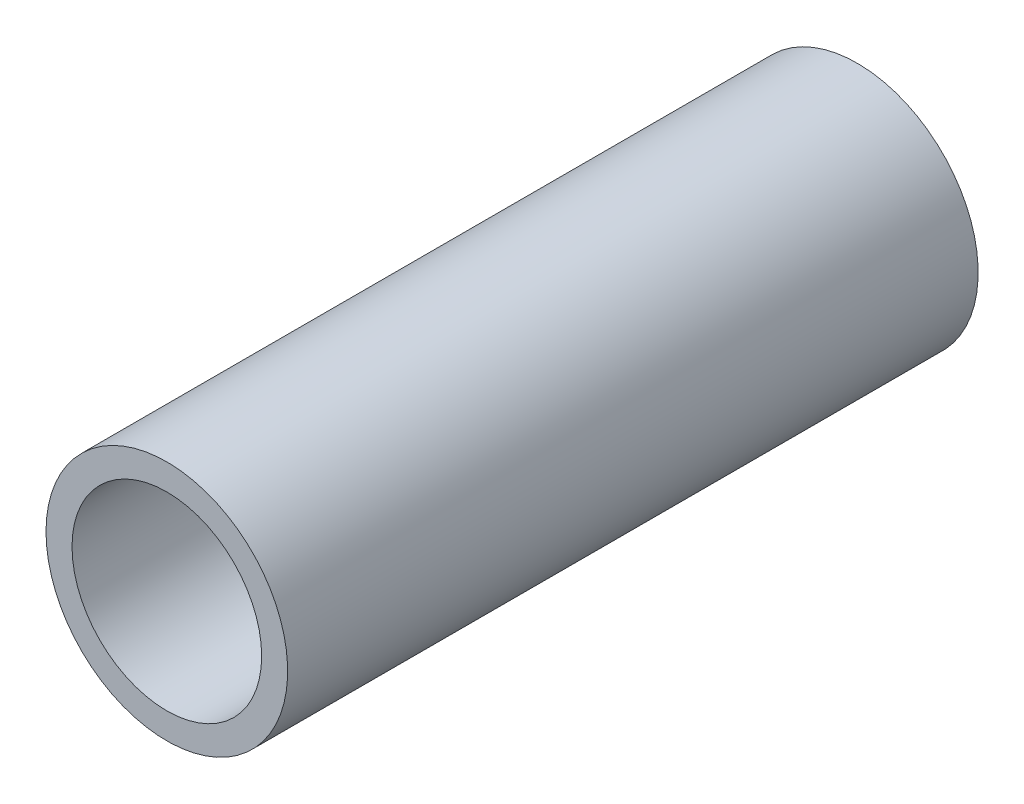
ISO-10303-21;
HEADER;
FILE_DESCRIPTION(('STEP AP214'),'2;1');
FILE_NAME('part.step','',(''),(''),'','','');
FILE_SCHEMA(('AUTOMOTIVE_DESIGN { 1 0 10303 214 1 1 1 1 }'));
ENDSEC;
DATA;
#1=APPLICATION_CONTEXT('core data for automotive mechanical design processes');
#2=APPLICATION_PROTOCOL_DEFINITION('international standard','automotive_design',2000,#1);
#3=PRODUCT_CONTEXT('',#1,'mechanical');
#4=PRODUCT('Part','Part','',(#3));
#5=PRODUCT_RELATED_PRODUCT_CATEGORY('part','',(#4));
#6=PRODUCT_DEFINITION_FORMATION('','',#4);
#7=PRODUCT_DEFINITION_CONTEXT('part definition',#1,'design');
#8=PRODUCT_DEFINITION('design','',#6,#7);
#9=PRODUCT_DEFINITION_SHAPE('','',#8);
#10=(LENGTH_UNIT() NAMED_UNIT(*) SI_UNIT(.MILLI.,.METRE.));
#11=(NAMED_UNIT(*) PLANE_ANGLE_UNIT() SI_UNIT($,.RADIAN.));
#12=(NAMED_UNIT(*) SI_UNIT($,.STERADIAN.) SOLID_ANGLE_UNIT());
#13=UNCERTAINTY_MEASURE_WITH_UNIT(LENGTH_MEASURE(1.E-05),#10,'distance_accuracy_value','');
#14=(GEOMETRIC_REPRESENTATION_CONTEXT(3) GLOBAL_UNCERTAINTY_ASSIGNED_CONTEXT((#13)) GLOBAL_UNIT_ASSIGNED_CONTEXT((#10,
#11,#12)) REPRESENTATION_CONTEXT('',''));
#15=CARTESIAN_POINT('',(0.,0.,0.));
#16=DIRECTION('',(0.,0.,1.));
#17=DIRECTION('',(1.,0.,0.));
#18=AXIS2_PLACEMENT_3D('',#15,#16,#17);
#19=CARTESIAN_POINT('',(0.,0.,76.2));
#20=DIRECTION('',(0.,0.,1.));
#21=DIRECTION('',(1.,0.,0.));
#22=AXIS2_PLACEMENT_3D('',#19,#20,#21);
#23=PLANE('',#22);
#24=CARTESIAN_POINT('',(0.,0.,76.2));
#25=DIRECTION('',(0.,0.,1.));
#26=DIRECTION('',(1.,0.,0.));
#27=AXIS2_PLACEMENT_3D('',#24,#25,#26);
#28=CIRCLE('',#27,13.335);
#29=CARTESIAN_POINT('',(-13.335,0.,76.2));
#30=VERTEX_POINT('',#29);
#31=EDGE_CURVE('E10',#30,#30,#28,.T.);
#32=ORIENTED_EDGE('',*,*,#31,.T.);
#33=EDGE_LOOP('',(#32));
#34=FACE_BOUND('',#33,.T.);
#35=CARTESIAN_POINT('',(0.,0.,76.2));
#36=DIRECTION('',(0.,0.,1.));
#37=DIRECTION('',(1.,0.,0.));
#38=AXIS2_PLACEMENT_3D('',#35,#36,#37);
#39=CIRCLE('',#38,10.4648);
#40=CARTESIAN_POINT('',(-10.4648,0.,76.2));
#41=VERTEX_POINT('',#40);
#42=EDGE_CURVE('E41',#41,#41,#39,.T.);
#43=ORIENTED_EDGE('',*,*,#42,.F.);
#44=EDGE_LOOP('',(#43));
#45=FACE_BOUND('',#44,.T.);
#46=ADVANCED_FACE('F30',(#34,#45),#23,.T.);
#47=CARTESIAN_POINT('',(0.,0.,0.));
#48=DIRECTION('',(0.,0.,1.));
#49=DIRECTION('',(1.,0.,0.));
#50=AXIS2_PLACEMENT_3D('',#47,#48,#49);
#51=PLANE('',#50);
#52=CARTESIAN_POINT('',(0.,0.,0.));
#53=DIRECTION('',(0.,0.,1.));
#54=DIRECTION('',(1.,0.,0.));
#55=AXIS2_PLACEMENT_3D('',#52,#53,#54);
#56=CIRCLE('',#55,13.335);
#57=CARTESIAN_POINT('',(-13.335,0.,0.));
#58=VERTEX_POINT('',#57);
#59=EDGE_CURVE('E34',#58,#58,#56,.T.);
#60=ORIENTED_EDGE('',*,*,#59,.F.);
#61=EDGE_LOOP('',(#60));
#62=FACE_BOUND('',#61,.T.);
#63=CARTESIAN_POINT('',(0.,0.,0.));
#64=DIRECTION('',(0.,0.,1.));
#65=DIRECTION('',(1.,0.,0.));
#66=AXIS2_PLACEMENT_3D('',#63,#64,#65);
#67=CIRCLE('',#66,10.4648);
#68=CARTESIAN_POINT('',(-10.4648,0.,0.));
#69=VERTEX_POINT('',#68);
#70=EDGE_CURVE('E43',#69,#69,#67,.T.);
#71=ORIENTED_EDGE('',*,*,#70,.T.);
#72=EDGE_LOOP('',(#71));
#73=FACE_BOUND('',#72,.T.);
#74=ADVANCED_FACE('F53',(#62,#73),#51,.F.);
#75=CARTESIAN_POINT('',(0.,0.,76.2));
#76=DIRECTION('',(0.,0.,-1.));
#77=DIRECTION('',(-1.,0.,0.));
#78=AXIS2_PLACEMENT_3D('',#75,#76,#77);
#79=CYLINDRICAL_SURFACE('',#78,13.335);
#80=CARTESIAN_POINT('',(-13.335,0.,76.2));
#81=CARTESIAN_POINT('',(-13.335,0.,75.40625));
#82=CARTESIAN_POINT('',(-13.335,0.,74.6125));
#83=CARTESIAN_POINT('',(-13.335,0.,73.025));
#84=CARTESIAN_POINT('',(-13.335,0.,72.23125));
#85=CARTESIAN_POINT('',(-13.335,0.,70.64375));
#86=CARTESIAN_POINT('',(-13.335,0.,69.85));
#87=CARTESIAN_POINT('',(-13.335,0.,68.2625));
#88=CARTESIAN_POINT('',(-13.335,0.,67.46875));
#89=CARTESIAN_POINT('',(-13.335,0.,65.88125));
#90=CARTESIAN_POINT('',(-13.335,0.,65.0875));
#91=CARTESIAN_POINT('',(-13.335,0.,63.5));
#92=CARTESIAN_POINT('',(-13.335,0.,62.70625));
#93=CARTESIAN_POINT('',(-13.335,0.,61.11875));
#94=CARTESIAN_POINT('',(-13.335,0.,60.325));
#95=CARTESIAN_POINT('',(-13.335,0.,58.7375));
#96=CARTESIAN_POINT('',(-13.335,0.,57.94375));
#97=CARTESIAN_POINT('',(-13.335,0.,56.35625));
#98=CARTESIAN_POINT('',(-13.335,0.,55.5625));
#99=CARTESIAN_POINT('',(-13.335,0.,53.975));
#100=CARTESIAN_POINT('',(-13.335,0.,53.18125));
#101=CARTESIAN_POINT('',(-13.335,0.,51.59375));
#102=CARTESIAN_POINT('',(-13.335,0.,50.8));
#103=CARTESIAN_POINT('',(-13.335,0.,49.2125));
#104=CARTESIAN_POINT('',(-13.335,0.,48.41875));
#105=CARTESIAN_POINT('',(-13.335,0.,46.83125));
#106=CARTESIAN_POINT('',(-13.335,0.,46.0375));
#107=CARTESIAN_POINT('',(-13.335,0.,44.45));
#108=CARTESIAN_POINT('',(-13.335,0.,43.65625));
#109=CARTESIAN_POINT('',(-13.335,0.,42.06875));
#110=CARTESIAN_POINT('',(-13.335,0.,41.275));
#111=CARTESIAN_POINT('',(-13.335,0.,39.6875));
#112=CARTESIAN_POINT('',(-13.335,0.,38.89375));
#113=CARTESIAN_POINT('',(-13.335,0.,37.30625));
#114=CARTESIAN_POINT('',(-13.335,0.,36.5125));
#115=CARTESIAN_POINT('',(-13.335,0.,34.925));
#116=CARTESIAN_POINT('',(-13.335,0.,34.13125));
#117=CARTESIAN_POINT('',(-13.335,0.,32.54375));
#118=CARTESIAN_POINT('',(-13.335,0.,31.75));
#119=CARTESIAN_POINT('',(-13.335,0.,30.1625));
#120=CARTESIAN_POINT('',(-13.335,0.,29.36875));
#121=CARTESIAN_POINT('',(-13.335,0.,27.78125));
#122=CARTESIAN_POINT('',(-13.335,0.,26.9875));
#123=CARTESIAN_POINT('',(-13.335,0.,25.4));
#124=CARTESIAN_POINT('',(-13.335,0.,24.60625));
#125=CARTESIAN_POINT('',(-13.335,0.,23.01875));
#126=CARTESIAN_POINT('',(-13.335,0.,22.225));
#127=CARTESIAN_POINT('',(-13.335,0.,20.6375));
#128=CARTESIAN_POINT('',(-13.335,0.,19.84375));
#129=CARTESIAN_POINT('',(-13.335,0.,18.25625));
#130=CARTESIAN_POINT('',(-13.335,0.,17.4625));
#131=CARTESIAN_POINT('',(-13.335,0.,15.875));
#132=CARTESIAN_POINT('',(-13.335,0.,15.08125));
#133=CARTESIAN_POINT('',(-13.335,0.,13.49375));
#134=CARTESIAN_POINT('',(-13.335,0.,12.7));
#135=CARTESIAN_POINT('',(-13.335,0.,11.1125));
#136=CARTESIAN_POINT('',(-13.335,0.,10.31875));
#137=CARTESIAN_POINT('',(-13.335,0.,8.73125));
#138=CARTESIAN_POINT('',(-13.335,0.,7.93750000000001));
#139=CARTESIAN_POINT('',(-13.335,0.,6.35));
#140=CARTESIAN_POINT('',(-13.335,0.,5.55625));
#141=CARTESIAN_POINT('',(-13.335,0.,3.96875));
#142=CARTESIAN_POINT('',(-13.335,0.,3.175));
#143=CARTESIAN_POINT('',(-13.335,0.,1.5875));
#144=CARTESIAN_POINT('',(-13.335,0.,0.793750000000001));
#145=CARTESIAN_POINT('',(-13.335,0.,0.));
#146=B_SPLINE_CURVE_WITH_KNOTS('',3,(#80,#81,#82,#83,#84,#85,#86,#87,#88,#89,#90,#91,#92,#93,
#94,#95,#96,#97,#98,#99,#100,#101,#102,#103,#104,#105,#106,#107,#108,#109,#110,#111,#112,#113,
#114,#115,#116,#117,#118,#119,#120,#121,#122,#123,#124,#125,#126,#127,#128,#129,#130,#131,#132,
#133,#134,#135,#136,#137,#138,#139,#140,#141,#142,#143,#144,#145),.UNSPECIFIED.,.F.,.F.,(4,2,2,
2,2,2,2,2,2,2,2,2,2,2,2,2,2,2,2,2,2,2,2,2,2,2,2,2,2,2,2,2,4),(0.,2.38124999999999,
4.76249999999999,7.14374999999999,9.52499999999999,11.90625,14.2875,16.66875,19.05,21.43125,
23.8125,26.19375,28.575,30.95625,33.3375,35.71875,38.1,40.48125,42.8625,45.24375,47.625,
50.00625,52.3875,54.76875,57.15,59.53125,61.9125,64.29375,66.675,69.05625,71.4375,73.81875,
76.2),.UNSPECIFIED.);
#147=EDGE_CURVE('BSEAM32',#30,#58,#146,.T.);
#148=ORIENTED_EDGE('',*,*,#31,.F.);
#149=ORIENTED_EDGE('',*,*,#59,.T.);
#150=ORIENTED_EDGE('',*,*,#147,.T.);
#151=ORIENTED_EDGE('',*,*,#147,.F.);
#152=EDGE_LOOP('',(#148,#150,#149,#151));
#153=FACE_BOUND('',#152,.T.);
#154=ADVANCED_FACE('F32',(#153),#79,.T.);
#155=CARTESIAN_POINT('',(0.,0.,76.2));
#156=DIRECTION('',(0.,0.,-1.));
#157=DIRECTION('',(-1.,0.,0.));
#158=AXIS2_PLACEMENT_3D('',#155,#156,#157);
#159=CYLINDRICAL_SURFACE('',#158,10.4648);
#160=CARTESIAN_POINT('',(-10.4648,0.,76.2));
#161=CARTESIAN_POINT('',(-10.4648,0.,75.40625));
#162=CARTESIAN_POINT('',(-10.4648,0.,74.6125));
#163=CARTESIAN_POINT('',(-10.4648,0.,73.025));
#164=CARTESIAN_POINT('',(-10.4648,0.,72.23125));
#165=CARTESIAN_POINT('',(-10.4648,0.,70.64375));
#166=CARTESIAN_POINT('',(-10.4648,0.,69.85));
#167=CARTESIAN_POINT('',(-10.4648,0.,68.2625));
#168=CARTESIAN_POINT('',(-10.4648,0.,67.46875));
#169=CARTESIAN_POINT('',(-10.4648,0.,65.88125));
#170=CARTESIAN_POINT('',(-10.4648,0.,65.0875));
#171=CARTESIAN_POINT('',(-10.4648,0.,63.5));
#172=CARTESIAN_POINT('',(-10.4648,0.,62.70625));
#173=CARTESIAN_POINT('',(-10.4648,0.,61.11875));
#174=CARTESIAN_POINT('',(-10.4648,0.,60.325));
#175=CARTESIAN_POINT('',(-10.4648,0.,58.7375));
#176=CARTESIAN_POINT('',(-10.4648,0.,57.94375));
#177=CARTESIAN_POINT('',(-10.4648,0.,56.35625));
#178=CARTESIAN_POINT('',(-10.4648,0.,55.5625));
#179=CARTESIAN_POINT('',(-10.4648,0.,53.975));
#180=CARTESIAN_POINT('',(-10.4648,0.,53.18125));
#181=CARTESIAN_POINT('',(-10.4648,0.,51.59375));
#182=CARTESIAN_POINT('',(-10.4648,0.,50.8));
#183=CARTESIAN_POINT('',(-10.4648,0.,49.2125));
#184=CARTESIAN_POINT('',(-10.4648,0.,48.41875));
#185=CARTESIAN_POINT('',(-10.4648,0.,46.83125));
#186=CARTESIAN_POINT('',(-10.4648,0.,46.0375));
#187=CARTESIAN_POINT('',(-10.4648,0.,44.45));
#188=CARTESIAN_POINT('',(-10.4648,0.,43.65625));
#189=CARTESIAN_POINT('',(-10.4648,0.,42.06875));
#190=CARTESIAN_POINT('',(-10.4648,0.,41.275));
#191=CARTESIAN_POINT('',(-10.4648,0.,39.6875));
#192=CARTESIAN_POINT('',(-10.4648,0.,38.89375));
#193=CARTESIAN_POINT('',(-10.4648,0.,37.30625));
#194=CARTESIAN_POINT('',(-10.4648,0.,36.5125));
#195=CARTESIAN_POINT('',(-10.4648,0.,34.925));
#196=CARTESIAN_POINT('',(-10.4648,0.,34.13125));
#197=CARTESIAN_POINT('',(-10.4648,0.,32.54375));
#198=CARTESIAN_POINT('',(-10.4648,0.,31.75));
#199=CARTESIAN_POINT('',(-10.4648,0.,30.1625));
#200=CARTESIAN_POINT('',(-10.4648,0.,29.36875));
#201=CARTESIAN_POINT('',(-10.4648,0.,27.78125));
#202=CARTESIAN_POINT('',(-10.4648,0.,26.9875));
#203=CARTESIAN_POINT('',(-10.4648,0.,25.4));
#204=CARTESIAN_POINT('',(-10.4648,0.,24.60625));
#205=CARTESIAN_POINT('',(-10.4648,0.,23.01875));
#206=CARTESIAN_POINT('',(-10.4648,0.,22.225));
#207=CARTESIAN_POINT('',(-10.4648,0.,20.6375));
#208=CARTESIAN_POINT('',(-10.4648,0.,19.84375));
#209=CARTESIAN_POINT('',(-10.4648,0.,18.25625));
#210=CARTESIAN_POINT('',(-10.4648,0.,17.4625));
#211=CARTESIAN_POINT('',(-10.4648,0.,15.875));
#212=CARTESIAN_POINT('',(-10.4648,0.,15.08125));
#213=CARTESIAN_POINT('',(-10.4648,0.,13.49375));
#214=CARTESIAN_POINT('',(-10.4648,0.,12.7));
#215=CARTESIAN_POINT('',(-10.4648,0.,11.1125));
#216=CARTESIAN_POINT('',(-10.4648,0.,10.31875));
#217=CARTESIAN_POINT('',(-10.4648,0.,8.73125));
#218=CARTESIAN_POINT('',(-10.4648,0.,7.93750000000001));
#219=CARTESIAN_POINT('',(-10.4648,0.,6.35));
#220=CARTESIAN_POINT('',(-10.4648,0.,5.55625));
#221=CARTESIAN_POINT('',(-10.4648,0.,3.96875));
#222=CARTESIAN_POINT('',(-10.4648,0.,3.175));
#223=CARTESIAN_POINT('',(-10.4648,0.,1.5875));
#224=CARTESIAN_POINT('',(-10.4648,0.,0.793750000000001));
#225=CARTESIAN_POINT('',(-10.4648,0.,0.));
#226=B_SPLINE_CURVE_WITH_KNOTS('',3,(#160,#161,#162,#163,#164,#165,#166,#167,#168,#169,#170,
#171,#172,#173,#174,#175,#176,#177,#178,#179,#180,#181,#182,#183,#184,#185,#186,#187,#188,#189,
#190,#191,#192,#193,#194,#195,#196,#197,#198,#199,#200,#201,#202,#203,#204,#205,#206,#207,#208,
#209,#210,#211,#212,#213,#214,#215,#216,#217,#218,#219,#220,#221,#222,#223,#224,#225),
.UNSPECIFIED.,.F.,.F.,(4,2,2,2,2,2,2,2,2,2,2,2,2,2,2,2,2,2,2,2,2,2,2,2,2,2,2,2,2,2,2,2,4),(0.,
2.38124999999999,4.76249999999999,7.14374999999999,9.52499999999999,11.90625,14.2875,16.66875,
19.05,21.43125,23.8125,26.19375,28.575,30.95625,33.3375,35.71875,38.1,40.48125,42.8625,45.24375,
47.625,50.00625,52.3875,54.76875,57.15,59.53125,61.9125,64.29375,66.675,69.05625,71.4375,
73.81875,76.2),.UNSPECIFIED.);
#227=EDGE_CURVE('BSEAM49',#41,#69,#226,.T.);
#228=ORIENTED_EDGE('',*,*,#42,.T.);
#229=ORIENTED_EDGE('',*,*,#70,.F.);
#230=ORIENTED_EDGE('',*,*,#227,.T.);
#231=ORIENTED_EDGE('',*,*,#227,.F.);
#232=EDGE_LOOP('',(#228,#230,#229,#231));
#233=FACE_BOUND('',#232,.T.);
#234=ADVANCED_FACE('F49',(#233),#159,.F.);
#235=CLOSED_SHELL('',(#46,#74,#154,#234));
#236=MANIFOLD_SOLID_BREP('B2',#235);
#237=ADVANCED_BREP_SHAPE_REPRESENTATION('',(#18,#236),#14);
#238=SHAPE_DEFINITION_REPRESENTATION(#9,#237);
ENDSEC;
END-ISO-10303-21;
